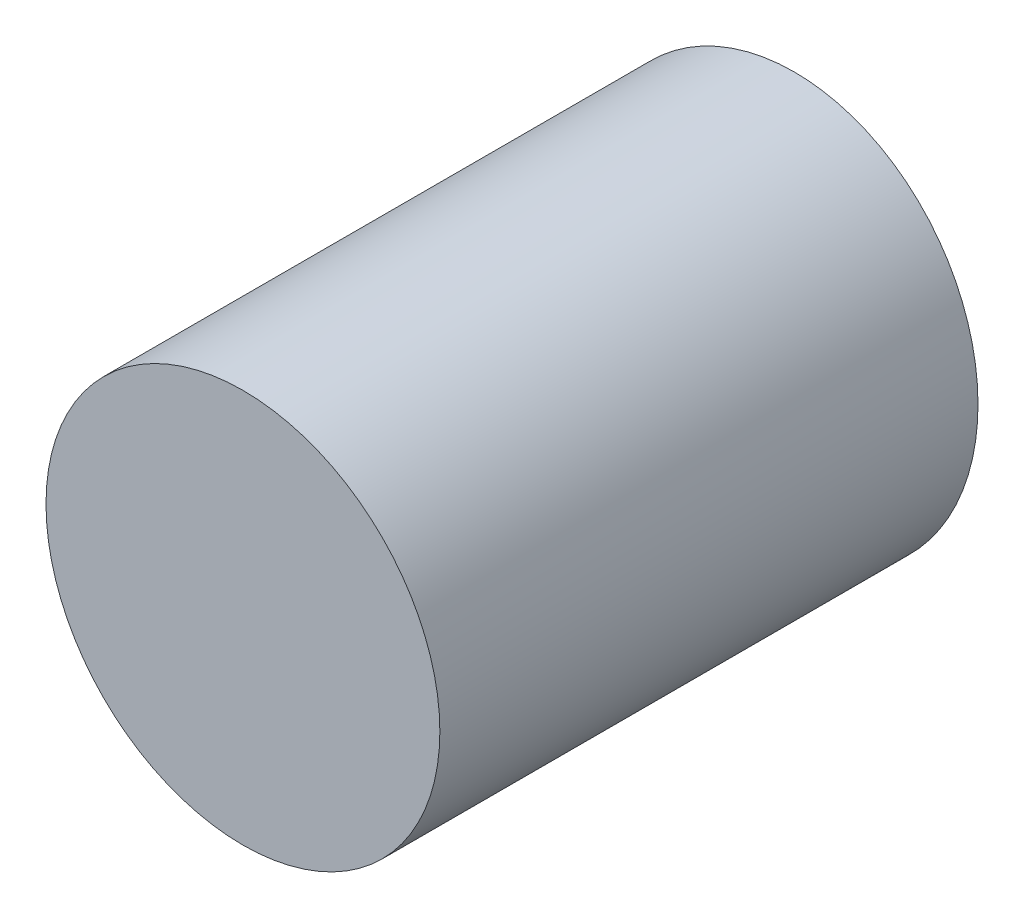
ISO-10303-21;
HEADER;
FILE_DESCRIPTION(('STEP AP214'),'2;1');
FILE_NAME('part.step','',(''),(''),'','','');
FILE_SCHEMA(('AUTOMOTIVE_DESIGN { 1 0 10303 214 1 1 1 1 }'));
ENDSEC;
DATA;
#1=APPLICATION_CONTEXT('core data for automotive mechanical design processes');
#2=APPLICATION_PROTOCOL_DEFINITION('international standard','automotive_design',2000,#1);
#3=PRODUCT_CONTEXT('',#1,'mechanical');
#4=PRODUCT('Part','Part','',(#3));
#5=PRODUCT_RELATED_PRODUCT_CATEGORY('part','',(#4));
#6=PRODUCT_DEFINITION_FORMATION('','',#4);
#7=PRODUCT_DEFINITION_CONTEXT('part definition',#1,'design');
#8=PRODUCT_DEFINITION('design','',#6,#7);
#9=PRODUCT_DEFINITION_SHAPE('','',#8);
#10=(LENGTH_UNIT() NAMED_UNIT(*) SI_UNIT(.MILLI.,.METRE.));
#11=(NAMED_UNIT(*) PLANE_ANGLE_UNIT() SI_UNIT($,.RADIAN.));
#12=(NAMED_UNIT(*) SI_UNIT($,.STERADIAN.) SOLID_ANGLE_UNIT());
#13=UNCERTAINTY_MEASURE_WITH_UNIT(LENGTH_MEASURE(1.E-05),#10,'distance_accuracy_value','');
#14=(GEOMETRIC_REPRESENTATION_CONTEXT(3) GLOBAL_UNCERTAINTY_ASSIGNED_CONTEXT((#13)) GLOBAL_UNIT_ASSIGNED_CONTEXT((#10,
#11,#12)) REPRESENTATION_CONTEXT('',''));
#15=CARTESIAN_POINT('',(0.,0.,0.));
#16=DIRECTION('',(0.,0.,1.));
#17=DIRECTION('',(1.,0.,0.));
#18=AXIS2_PLACEMENT_3D('',#15,#16,#17);
#19=CARTESIAN_POINT('',(0.,0.,8.89));
#20=DIRECTION('',(0.,0.,-1.));
#21=DIRECTION('',(-1.,0.,0.));
#22=AXIS2_PLACEMENT_3D('',#19,#20,#21);
#23=CYLINDRICAL_SURFACE('',#22,3.175);
#24=CARTESIAN_POINT('',(0.,0.,0.222017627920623));
#25=DIRECTION('',(0.,0.0697564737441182,0.997564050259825));
#26=DIRECTION('',(0.,0.997564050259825,-0.0697564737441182));
#27=AXIS2_PLACEMENT_3D('',#24,#25,#26);
#28=ELLIPSE('',#27,3.18275302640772,3.175);
#29=CARTESIAN_POINT('',(0.,3.175,0.));
#30=VERTEX_POINT('',#29);
#31=EDGE_CURVE('E35',#30,#30,#28,.T.);
#32=ORIENTED_EDGE('',*,*,#31,.T.);
#33=EDGE_LOOP('',(#32));
#34=FACE_BOUND('',#33,.T.);
#35=CARTESIAN_POINT('',(0.,0.,8.89));
#36=DIRECTION('',(0.,0.,1.));
#37=DIRECTION('',(1.,0.,0.));
#38=AXIS2_PLACEMENT_3D('',#35,#36,#37);
#39=CIRCLE('',#38,3.175);
#40=CARTESIAN_POINT('',(3.175,0.,8.89));
#41=VERTEX_POINT('',#40);
#42=EDGE_CURVE('E10',#41,#41,#39,.T.);
#43=ORIENTED_EDGE('',*,*,#42,.F.);
#44=EDGE_LOOP('',(#43));
#45=FACE_BOUND('',#44,.T.);
#46=ADVANCED_FACE('F29',(#34,#45),#23,.T.);
#47=CARTESIAN_POINT('',(0.,0.,8.89));
#48=DIRECTION('',(0.,0.,1.));
#49=DIRECTION('',(1.,0.,0.));
#50=AXIS2_PLACEMENT_3D('',#47,#48,#49);
#51=PLANE('',#50);
#52=ORIENTED_EDGE('',*,*,#42,.T.);
#53=EDGE_LOOP('',(#52));
#54=FACE_BOUND('',#53,.T.);
#55=ADVANCED_FACE('F54',(#54),#51,.T.);
#56=CARTESIAN_POINT('',(-6.35,3.175,0.));
#57=DIRECTION('',(0.,0.0697564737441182,0.997564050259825));
#58=DIRECTION('',(0.,-0.997564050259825,0.0697564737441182));
#59=AXIS2_PLACEMENT_3D('',#56,#57,#58);
#60=PLANE('',#59);
#61=CARTESIAN_POINT('',(0.,0.015449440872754,0.220937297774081));
#62=DIRECTION('',(0.,-0.0697564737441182,-0.997564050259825));
#63=DIRECTION('',(0.,0.997564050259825,-0.0697564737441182));
#64=AXIS2_PLACEMENT_3D('',#61,#62,#63);
#65=CIRCLE('',#64,1.143);
#66=CARTESIAN_POINT('',(0.,1.15566515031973,0.141205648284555));
#67=VERTEX_POINT('',#66);
#68=EDGE_CURVE('E43',#67,#67,#65,.T.);
#69=ORIENTED_EDGE('',*,*,#68,.F.);
#70=EDGE_LOOP('',(#69));
#71=FACE_BOUND('',#70,.T.);
#72=ORIENTED_EDGE('',*,*,#31,.F.);
#73=EDGE_LOOP('',(#72));
#74=FACE_BOUND('',#73,.T.);
#75=ADVANCED_FACE('F51',(#71,#74),#60,.F.);
#76=CARTESIAN_POINT('',(0.,0.192630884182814,2.75474998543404));
#77=DIRECTION('',(0.,-0.0697564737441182,-0.997564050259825));
#78=DIRECTION('',(0.,0.997564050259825,-0.0697564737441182));
#79=AXIS2_PLACEMENT_3D('',#76,#77,#78);
#80=CYLINDRICAL_SURFACE('',#79,1.143);
#81=CARTESIAN_POINT('',(0.,0.192630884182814,2.75474998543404));
#82=DIRECTION('',(0.,-0.0697564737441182,-0.997564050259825));
#83=DIRECTION('',(0.,0.997564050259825,-0.0697564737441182));
#84=AXIS2_PLACEMENT_3D('',#81,#82,#83);
#85=CIRCLE('',#84,1.143);
#86=CARTESIAN_POINT('',(0.,1.33284659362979,2.67501833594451));
#87=VERTEX_POINT('',#86);
#88=EDGE_CURVE('E39',#87,#87,#85,.T.);
#89=CARTESIAN_POINT('',(0.,1.33284659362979,2.67501833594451));
#90=CARTESIAN_POINT('',(0.,1.33100095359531,2.64862445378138));
#91=CARTESIAN_POINT('',(0.,1.32915531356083,2.62223057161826));
#92=CARTESIAN_POINT('',(0.,1.32546403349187,2.56944280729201));
#93=CARTESIAN_POINT('',(0.,1.32361839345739,2.54304892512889));
#94=CARTESIAN_POINT('',(0.,1.31992711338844,2.49026116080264));
#95=CARTESIAN_POINT('',(0.,1.31808147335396,2.46386727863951));
#96=CARTESIAN_POINT('',(0.,1.314390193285,2.41107951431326));
#97=CARTESIAN_POINT('',(0.,1.31254455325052,2.38468563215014));
#98=CARTESIAN_POINT('',(0.,1.30885327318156,2.33189786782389));
#99=CARTESIAN_POINT('',(0.,1.30700763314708,2.30550398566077));
#100=CARTESIAN_POINT('',(0.,1.30331635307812,2.25271622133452));
#101=CARTESIAN_POINT('',(0.,1.30147071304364,2.22632233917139));
#102=CARTESIAN_POINT('',(0.,1.29777943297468,2.17353457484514));
#103=CARTESIAN_POINT('',(0.,1.2959337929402,2.14714069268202));
#104=CARTESIAN_POINT('',(0.,1.29224251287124,2.09435292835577));
#105=CARTESIAN_POINT('',(0.,1.29039687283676,2.06795904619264));
#106=CARTESIAN_POINT('',(0.,1.2867055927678,2.0151712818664));
#107=CARTESIAN_POINT('',(0.,1.28485995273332,1.98877739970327));
#108=CARTESIAN_POINT('',(0.,1.28116867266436,1.93598963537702));
#109=CARTESIAN_POINT('',(0.,1.27932303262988,1.9095957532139));
#110=CARTESIAN_POINT('',(0.,1.27563175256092,1.85680798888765));
#111=CARTESIAN_POINT('',(0.,1.27378611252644,1.83041410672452));
#112=CARTESIAN_POINT('',(0.,1.27009483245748,1.77762634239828));
#113=CARTESIAN_POINT('',(0.,1.268249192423,1.75123246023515));
#114=CARTESIAN_POINT('',(0.,1.26455791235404,1.6984446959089));
#115=CARTESIAN_POINT('',(0.,1.26271227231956,1.67205081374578));
#116=CARTESIAN_POINT('',(0.,1.2590209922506,1.61926304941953));
#117=CARTESIAN_POINT('',(0.,1.25717535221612,1.5928691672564));
#118=CARTESIAN_POINT('',(0.,1.25348407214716,1.54008140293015));
#119=CARTESIAN_POINT('',(0.,1.25163843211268,1.51368752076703));
#120=CARTESIAN_POINT('',(0.,1.24794715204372,1.46089975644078));
#121=CARTESIAN_POINT('',(0.,1.24610151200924,1.43450587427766));
#122=CARTESIAN_POINT('',(0.,1.24241023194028,1.38171810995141));
#123=CARTESIAN_POINT('',(0.,1.2405645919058,1.35532422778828));
#124=CARTESIAN_POINT('',(0.,1.23687331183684,1.30253646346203));
#125=CARTESIAN_POINT('',(0.,1.23502767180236,1.27614258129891));
#126=CARTESIAN_POINT('',(0.,1.23133639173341,1.22335481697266));
#127=CARTESIAN_POINT('',(0.,1.22949075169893,1.19696093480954));
#128=CARTESIAN_POINT('',(0.,1.22579947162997,1.14417317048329));
#129=CARTESIAN_POINT('',(0.,1.22395383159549,1.11777928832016));
#130=CARTESIAN_POINT('',(0.,1.22026255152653,1.06499152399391));
#131=CARTESIAN_POINT('',(0.,1.21841691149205,1.03859764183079));
#132=CARTESIAN_POINT('',(0.,1.21472563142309,0.98580987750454));
#133=CARTESIAN_POINT('',(0.,1.21287999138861,0.959415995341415));
#134=CARTESIAN_POINT('',(0.,1.20918871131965,0.906628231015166));
#135=CARTESIAN_POINT('',(0.,1.20734307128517,0.880234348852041));
#136=CARTESIAN_POINT('',(0.,1.20365179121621,0.827446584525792));
#137=CARTESIAN_POINT('',(0.,1.20180615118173,0.801052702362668));
#138=CARTESIAN_POINT('',(0.,1.19811487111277,0.748264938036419));
#139=CARTESIAN_POINT('',(0.,1.19626923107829,0.721871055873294));
#140=CARTESIAN_POINT('',(0.,1.19257795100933,0.669083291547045));
#141=CARTESIAN_POINT('',(0.,1.19073231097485,0.642689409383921));
#142=CARTESIAN_POINT('',(0.,1.18704103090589,0.589901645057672));
#143=CARTESIAN_POINT('',(0.,1.18519539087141,0.563507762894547));
#144=CARTESIAN_POINT('',(0.,1.18150411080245,0.510719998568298));
#145=CARTESIAN_POINT('',(0.,1.17965847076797,0.484326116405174));
#146=CARTESIAN_POINT('',(0.,1.17596719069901,0.431538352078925));
#147=CARTESIAN_POINT('',(0.,1.17412155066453,0.4051444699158));
#148=CARTESIAN_POINT('',(0.,1.17043027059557,0.352356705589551));
#149=CARTESIAN_POINT('',(0.,1.16858463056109,0.325962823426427));
#150=CARTESIAN_POINT('',(0.,1.16489335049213,0.273175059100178));
#151=CARTESIAN_POINT('',(0.,1.16304771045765,0.246781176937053));
#152=CARTESIAN_POINT('',(0.,1.15935643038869,0.193993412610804));
#153=CARTESIAN_POINT('',(0.,1.15751079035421,0.167599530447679));
#154=CARTESIAN_POINT('',(0.,1.15566515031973,0.141205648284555));
#155=B_SPLINE_CURVE_WITH_KNOTS('',3,(#89,#90,#91,#92,#93,#94,#95,#96,#97,#98,#99,#100,#101,#102,
#103,#104,#105,#106,#107,#108,#109,#110,#111,#112,#113,#114,#115,#116,#117,#118,#119,#120,#121,
#122,#123,#124,#125,#126,#127,#128,#129,#130,#131,#132,#133,#134,#135,#136,#137,#138,#139,#140,
#141,#142,#143,#144,#145,#146,#147,#148,#149,#150,#151,#152,#153,#154),.UNSPECIFIED.,.F.,.F.,(4,
2,2,2,2,2,2,2,2,2,2,2,2,2,2,2,2,2,2,2,2,2,2,2,2,2,2,2,2,2,2,2,4),(0.,0.0793750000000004,0.15875,
0.238125,0.3175,0.396875,0.47625,0.555625,0.635,0.714375,0.79375,0.873125,0.9525,1.031875,
1.11125,1.190625,1.27,1.349375,1.42875,1.508125,1.5875,1.666875,1.74625,1.825625,1.905,1.984375,
2.06375,2.143125,2.2225,2.301875,2.38125,2.460625,2.54),.UNSPECIFIED.);
#156=EDGE_CURVE('BSEAM49',#87,#67,#155,.T.);
#157=ORIENTED_EDGE('',*,*,#88,.F.);
#158=ORIENTED_EDGE('',*,*,#68,.T.);
#159=ORIENTED_EDGE('',*,*,#156,.T.);
#160=ORIENTED_EDGE('',*,*,#156,.F.);
#161=EDGE_LOOP('',(#157,#159,#158,#160));
#162=FACE_BOUND('',#161,.T.);
#163=ADVANCED_FACE('F49',(#162),#80,.F.);
#164=CARTESIAN_POINT('',(0.,0.192630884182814,2.75474998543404));
#165=DIRECTION('',(0.,-0.0697564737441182,-0.997564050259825));
#166=DIRECTION('',(0.,0.997564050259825,-0.0697564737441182));
#167=AXIS2_PLACEMENT_3D('',#164,#165,#166);
#168=PLANE('',#167);
#169=ORIENTED_EDGE('',*,*,#88,.T.);
#170=EDGE_LOOP('',(#169));
#171=FACE_BOUND('',#170,.T.);
#172=ADVANCED_FACE('F60',(#171),#168,.T.);
#173=CLOSED_SHELL('',(#46,#55,#75,#163,#172));
#174=MANIFOLD_SOLID_BREP('B2',#173);
#175=ADVANCED_BREP_SHAPE_REPRESENTATION('',(#18,#174),#14);
#176=SHAPE_DEFINITION_REPRESENTATION(#9,#175);
ENDSEC;
END-ISO-10303-21;
